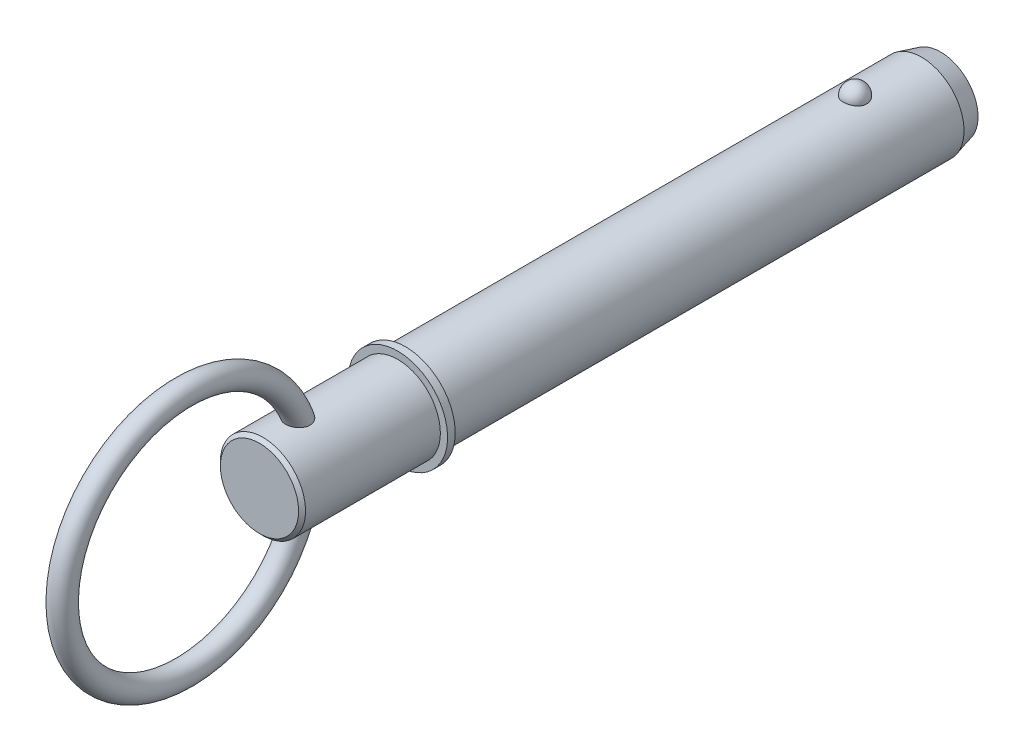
ISO-10303-21;
HEADER;
FILE_DESCRIPTION(('STEP AP214'),'2;1');
FILE_NAME('part.step','',(''),(''),'','','');
FILE_SCHEMA(('AUTOMOTIVE_DESIGN { 1 0 10303 214 1 1 1 1 }'));
ENDSEC;
DATA;
#1=APPLICATION_CONTEXT('core data for automotive mechanical design processes');
#2=APPLICATION_PROTOCOL_DEFINITION('international standard','automotive_design',2000,#1);
#3=PRODUCT_CONTEXT('',#1,'mechanical');
#4=PRODUCT('Part','Part','',(#3));
#5=PRODUCT_RELATED_PRODUCT_CATEGORY('part','',(#4));
#6=PRODUCT_DEFINITION_FORMATION('','',#4);
#7=PRODUCT_DEFINITION_CONTEXT('part definition',#1,'design');
#8=PRODUCT_DEFINITION('design','',#6,#7);
#9=PRODUCT_DEFINITION_SHAPE('','',#8);
#10=(LENGTH_UNIT() NAMED_UNIT(*) SI_UNIT(.MILLI.,.METRE.));
#11=(NAMED_UNIT(*) PLANE_ANGLE_UNIT() SI_UNIT($,.RADIAN.));
#12=(NAMED_UNIT(*) SI_UNIT($,.STERADIAN.) SOLID_ANGLE_UNIT());
#13=UNCERTAINTY_MEASURE_WITH_UNIT(LENGTH_MEASURE(1.E-05),#10,'distance_accuracy_value','');
#14=(GEOMETRIC_REPRESENTATION_CONTEXT(3) GLOBAL_UNCERTAINTY_ASSIGNED_CONTEXT((#13)) GLOBAL_UNIT_ASSIGNED_CONTEXT((#10,
#11,#12)) REPRESENTATION_CONTEXT('',''));
#15=CARTESIAN_POINT('',(0.,0.,0.));
#16=DIRECTION('',(0.,0.,1.));
#17=DIRECTION('',(1.,0.,0.));
#18=AXIS2_PLACEMENT_3D('',#15,#16,#17);
#19=CARTESIAN_POINT('',(0.,0.,114.3));
#20=DIRECTION('',(0.,0.,-1.));
#21=DIRECTION('',(-1.,0.,0.));
#22=AXIS2_PLACEMENT_3D('',#19,#20,#21);
#23=CYLINDRICAL_SURFACE('',#22,11.115);
#24=CARTESIAN_POINT('',(3.04058343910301,10.6910278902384,-3.07));
#25=CARTESIAN_POINT('',(3.04058039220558,10.6910304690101,-2.89837124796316));
#26=CARTESIAN_POINT('',(3.02657193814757,10.6950430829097,-2.72670368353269));
#27=CARTESIAN_POINT('',(2.97087341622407,10.7106465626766,-2.38822964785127));
#28=CARTESIAN_POINT('',(2.92917240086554,10.7222404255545,-2.22142512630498));
#29=CARTESIAN_POINT('',(2.81915317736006,10.751689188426,-1.89750816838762));
#30=CARTESIAN_POINT('',(2.75084669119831,10.7695413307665,-1.7403914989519));
#31=CARTESIAN_POINT('',(2.58932284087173,10.809510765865,-1.44013959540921));
#32=CARTESIAN_POINT('',(2.49610617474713,10.8316279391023,-1.29700396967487));
#33=CARTESIAN_POINT('',(2.28659317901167,10.877786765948,-1.02797591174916));
#34=CARTESIAN_POINT('',(2.17018825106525,10.9018371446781,-0.902169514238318));
#35=CARTESIAN_POINT('',(1.91759004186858,10.9490888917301,-0.672091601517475));
#36=CARTESIAN_POINT('',(1.78139672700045,10.9722902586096,-0.567820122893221));
#37=CARTESIAN_POINT('',(1.49327884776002,11.0151925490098,-0.383992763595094));
#38=CARTESIAN_POINT('',(1.34139928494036,11.034903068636,-0.30436866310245));
#39=CARTESIAN_POINT('',(1.02584823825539,11.0686948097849,-0.171731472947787));
#40=CARTESIAN_POINT('',(0.86217801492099,11.0827766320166,-0.118715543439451));
#41=CARTESIAN_POINT('',(0.530748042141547,11.1035404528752,-0.0415304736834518));
#42=CARTESIAN_POINT('',(0.363109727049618,11.1103474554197,-0.0168734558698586));
#43=CARTESIAN_POINT('',(0.0259327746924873,11.1162480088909,0.00453486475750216));
#44=CARTESIAN_POINT('',(-0.143605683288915,11.1153422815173,0.00128877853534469));
#45=CARTESIAN_POINT('',(-0.477280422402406,11.1059854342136,-0.0327676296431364));
#46=CARTESIAN_POINT('',(-0.641459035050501,11.0976393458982,-0.0631942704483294));
#47=CARTESIAN_POINT('',(-0.962236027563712,11.0744390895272,-0.150220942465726));
#48=CARTESIAN_POINT('',(-1.11883427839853,11.0595848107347,-0.20682141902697));
#49=CARTESIAN_POINT('',(-1.4210461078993,11.0248420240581,-0.345028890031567));
#50=CARTESIAN_POINT('',(-1.56659244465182,11.0049254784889,-0.426775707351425));
#51=CARTESIAN_POINT('',(-1.84189316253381,10.9622119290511,-0.612956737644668));
#52=CARTESIAN_POINT('',(-1.97164597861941,10.9394146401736,-0.71739319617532));
#53=CARTESIAN_POINT('',(-2.21432263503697,10.8929139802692,-0.948332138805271));
#54=CARTESIAN_POINT('',(-2.3268890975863,10.8692016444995,-1.07520847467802));
#55=CARTESIAN_POINT('',(-2.52940007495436,10.8238699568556,-1.34622145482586));
#56=CARTESIAN_POINT('',(-2.6193430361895,10.8022507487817,-1.49035928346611));
#57=CARTESIAN_POINT('',(-2.77523958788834,10.7632629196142,-1.79367507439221));
#58=CARTESIAN_POINT('',(-2.8409151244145,10.7459442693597,-1.95300253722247));
#59=CARTESIAN_POINT('',(-2.94519180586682,10.7178360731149,-2.28083009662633));
#60=CARTESIAN_POINT('',(-2.98379371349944,10.707046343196,-2.44932993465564));
#61=CARTESIAN_POINT('',(-3.03284665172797,10.6932559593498,-2.78998091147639));
#62=CARTESIAN_POINT('',(-3.04341313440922,10.6902233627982,-2.96211412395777));
#63=CARTESIAN_POINT('',(-3.03646037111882,10.6922002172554,-3.305762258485));
#64=CARTESIAN_POINT('',(-3.0189418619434,10.6972094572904,-3.47727719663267));
#65=CARTESIAN_POINT('',(-2.95641582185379,10.7146564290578,-3.81396465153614));
#66=CARTESIAN_POINT('',(-2.91154117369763,10.7270582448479,-3.97916375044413));
#67=CARTESIAN_POINT('',(-2.79553341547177,10.7578713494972,-4.29947360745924));
#68=CARTESIAN_POINT('',(-2.72439927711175,10.7762828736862,-4.45458397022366));
#69=CARTESIAN_POINT('',(-2.55718900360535,10.8171819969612,-4.75123550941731));
#70=CARTESIAN_POINT('',(-2.46098224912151,10.8396907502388,-4.89270014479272));
#71=CARTESIAN_POINT('',(-2.24623042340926,10.8862165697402,-5.15724095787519));
#72=CARTESIAN_POINT('',(-2.12768452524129,10.9102336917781,-5.28031645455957));
#73=CARTESIAN_POINT('',(-1.87085107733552,10.9571990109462,-5.5050961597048));
#74=CARTESIAN_POINT('',(-1.73249451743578,10.9801430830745,-5.60672245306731));
#75=CARTESIAN_POINT('',(-1.44010079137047,11.0223008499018,-5.78517789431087));
#76=CARTESIAN_POINT('',(-1.28606470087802,11.0415148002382,-5.86200874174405));
#77=CARTESIAN_POINT('',(-0.968615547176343,11.0738491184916,-5.98788441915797));
#78=CARTESIAN_POINT('',(-0.805339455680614,11.0870408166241,-6.03725610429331));
#79=CARTESIAN_POINT('',(-0.47244987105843,11.1062048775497,-6.10820004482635));
#80=CARTESIAN_POINT('',(-0.302837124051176,11.11217808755,-6.1297755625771));
#81=CARTESIAN_POINT('',(0.0345765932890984,11.1162034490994,-6.14436196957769));
#82=CARTESIAN_POINT('',(0.20235372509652,11.1143988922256,-6.13788957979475));
#83=CARTESIAN_POINT('',(0.534364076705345,11.103390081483,-6.09773981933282));
#84=CARTESIAN_POINT('',(0.698597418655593,11.094186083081,-6.06406338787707));
#85=CARTESIAN_POINT('',(1.01830314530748,11.0694136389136,-5.97063285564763));
#86=CARTESIAN_POINT('',(1.17380497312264,11.0538682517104,-5.91097318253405));
#87=CARTESIAN_POINT('',(1.472484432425,11.0180608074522,-5.76723645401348));
#88=CARTESIAN_POINT('',(1.6156613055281,10.9977984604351,-5.68315789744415));
#89=CARTESIAN_POINT('',(1.88801614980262,10.9543574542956,-5.49138807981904));
#90=CARTESIAN_POINT('',(2.01695079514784,10.9311394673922,-5.38336024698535));
#91=CARTESIAN_POINT('',(2.25501495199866,10.8845248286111,-5.14733839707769));
#92=CARTESIAN_POINT('',(2.36414099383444,10.8611281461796,-5.01934088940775));
#93=CARTESIAN_POINT('',(2.56152595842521,10.8162958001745,-4.74447932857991));
#94=CARTESIAN_POINT('',(2.64940088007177,10.7948999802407,-4.59733288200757));
#95=CARTESIAN_POINT('',(2.79961494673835,10.7569242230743,-4.29001203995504));
#96=CARTESIAN_POINT('',(2.86196390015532,10.7403424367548,-4.12984267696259));
#97=CARTESIAN_POINT('',(2.95377333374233,10.715429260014,-3.820623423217));
#98=CARTESIAN_POINT('',(2.98627018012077,10.7063495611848,-3.6725268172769));
#99=CARTESIAN_POINT('',(3.02967634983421,10.6941478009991,-3.37296350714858));
#100=CARTESIAN_POINT('',(3.04058612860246,10.6910256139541,-3.22149687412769));
#101=CARTESIAN_POINT('',(3.04058343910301,10.6910278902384,-3.07));
#102=B_SPLINE_CURVE_WITH_KNOTS('',3,(#24,#25,#26,#27,#28,#29,#30,#31,#32,#33,#34,#35,#36,#37,
#38,#39,#40,#41,#42,#43,#44,#45,#46,#47,#48,#49,#50,#51,#52,#53,#54,#55,#56,#57,#58,#59,#60,#61,
#62,#63,#64,#65,#66,#67,#68,#69,#70,#71,#72,#73,#74,#75,#76,#77,#78,#79,#80,#81,#82,#83,#84,#85,
#86,#87,#88,#89,#90,#91,#92,#93,#94,#95,#96,#97,#98,#99,#100,#101),.UNSPECIFIED.,.T.,.F.,(4,2,2,
2,2,2,2,2,2,2,2,2,2,2,2,2,2,2,2,2,2,2,2,2,2,2,2,2,2,2,2,2,2,2,2,2,2,2,4),(0.,0.514341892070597,
1.02888723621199,1.54320613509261,2.0575106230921,2.57428293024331,3.09105611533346,
3.60638589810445,4.1216606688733,4.62793159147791,5.1341551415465,5.63334381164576,
6.13254097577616,6.63456562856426,7.13663998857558,7.64804063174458,8.15947638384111,
8.6766026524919,9.19371435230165,9.70869321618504,10.223658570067,10.7361421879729,
11.2486458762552,11.7638748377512,12.2791228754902,12.7962115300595,13.3132647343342,
13.8240238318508,14.3347229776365,14.8360540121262,15.3373677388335,15.8368746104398,
16.3364121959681,16.8434736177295,17.3506237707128,17.8663484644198,18.3818748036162,
18.8358944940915,19.2899046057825),.UNSPECIFIED.);
#103=CARTESIAN_POINT('',(3.04058343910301,10.6910278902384,-3.07));
#104=VERTEX_POINT('',#103);
#105=EDGE_CURVE('E100',#104,#104,#102,.T.);
#106=ORIENTED_EDGE('',*,*,#105,.T.);
#107=EDGE_LOOP('',(#106));
#108=FACE_BOUND('',#107,.T.);
#109=CARTESIAN_POINT('',(0.,0.,-20.3999999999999));
#110=DIRECTION('',(0.,0.,-1.));
#111=DIRECTION('',(-1.,0.,0.));
#112=AXIS2_PLACEMENT_3D('',#109,#110,#111);
#113=CIRCLE('',#112,11.115);
#114=CARTESIAN_POINT('',(-11.115,0.,-20.3999999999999));
#115=VERTEX_POINT('',#114);
#116=EDGE_CURVE('E108',#115,#115,#113,.F.);
#117=ORIENTED_EDGE('',*,*,#116,.T.);
#118=EDGE_LOOP('',(#117));
#119=FACE_BOUND('',#118,.T.);
#120=CARTESIAN_POINT('',(0.,0.,114.3));
#121=DIRECTION('',(0.,0.,1.));
#122=DIRECTION('',(1.,0.,0.));
#123=AXIS2_PLACEMENT_3D('',#120,#121,#122);
#124=CIRCLE('',#123,11.115);
#125=CARTESIAN_POINT('',(11.115,0.,114.3));
#126=VERTEX_POINT('',#125);
#127=EDGE_CURVE('E106',#126,#126,#124,.T.);
#128=ORIENTED_EDGE('',*,*,#127,.F.);
#129=EDGE_LOOP('',(#128));
#130=FACE_BOUND('',#129,.T.);
#131=ADVANCED_FACE('F39',(#108,#119,#130),#23,.T.);
#132=CARTESIAN_POINT('',(0.,0.,-25.4));
#133=DIRECTION('',(0.,0.,-1.));
#134=DIRECTION('',(-1.,0.,0.));
#135=AXIS2_PLACEMENT_3D('',#132,#133,#134);
#136=PLANE('',#135);
#137=CARTESIAN_POINT('',(0.,0.,-25.4));
#138=DIRECTION('',(0.,0.,-1.));
#139=DIRECTION('',(-1.,0.,0.));
#140=AXIS2_PLACEMENT_3D('',#137,#138,#139);
#141=CIRCLE('',#140,9.77525403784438);
#142=CARTESIAN_POINT('',(-9.77525403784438,0.,-25.4));
#143=VERTEX_POINT('',#142);
#144=EDGE_CURVE('E142',#143,#143,#141,.T.);
#145=ORIENTED_EDGE('',*,*,#144,.T.);
#146=EDGE_LOOP('',(#145));
#147=FACE_BOUND('',#146,.T.);
#148=ADVANCED_FACE('F86',(#147),#136,.T.);
#149=CARTESIAN_POINT('',(0.,0.,-25.4));
#150=DIRECTION('',(0.,0.,1.));
#151=DIRECTION('',(1.,0.,0.));
#152=AXIS2_PLACEMENT_3D('',#149,#150,#151);
#153=CONICAL_SURFACE('',#152,9.77525403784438,0.261799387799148);
#154=ORIENTED_EDGE('',*,*,#116,.F.);
#155=EDGE_LOOP('',(#154));
#156=FACE_BOUND('',#155,.T.);
#157=ORIENTED_EDGE('',*,*,#144,.F.);
#158=EDGE_LOOP('',(#157));
#159=FACE_BOUND('',#158,.T.);
#160=ADVANCED_FACE('F92',(#156,#159),#153,.T.);
#161=CARTESIAN_POINT('',(0.,11.115,-3.07));
#162=DIRECTION('',(0.,1.,0.));
#163=DIRECTION('',(0.,0.,1.));
#164=AXIS2_PLACEMENT_3D('',#161,#162,#163);
#165=SPHERICAL_SURFACE('',#164,3.07);
#166=ORIENTED_EDGE('',*,*,#105,.F.);
#167=EDGE_LOOP('',(#166));
#168=FACE_BOUND('',#167,.T.);
#169=ADVANCED_FACE('F111',(#168),#165,.T.);
#170=CARTESIAN_POINT('',(0.,0.,114.3));
#171=DIRECTION('',(0.,0.,-1.));
#172=DIRECTION('',(-1.,0.,0.));
#173=AXIS2_PLACEMENT_3D('',#170,#171,#172);
#174=PLANE('',#173);
#175=ORIENTED_EDGE('',*,*,#127,.T.);
#176=EDGE_LOOP('',(#175));
#177=FACE_BOUND('',#176,.T.);
#178=CARTESIAN_POINT('',(0.,0.,114.3));
#179=DIRECTION('',(0.,0.,-1.));
#180=DIRECTION('',(-1.,0.,0.));
#181=AXIS2_PLACEMENT_3D('',#178,#179,#180);
#182=CIRCLE('',#181,13.);
#183=CARTESIAN_POINT('',(-13.,0.,114.3));
#184=VERTEX_POINT('',#183);
#185=EDGE_CURVE('E107',#184,#184,#182,.T.);
#186=ORIENTED_EDGE('',*,*,#185,.T.);
#187=EDGE_LOOP('',(#186));
#188=FACE_BOUND('',#187,.T.);
#189=ADVANCED_FACE('F115',(#177,#188),#174,.T.);
#190=CARTESIAN_POINT('',(0.,0.,33.7287874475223));
#191=DIRECTION('',(0.,0.,-1.));
#192=DIRECTION('',(-1.,0.,0.));
#193=AXIS2_PLACEMENT_3D('',#190,#191,#192);
#194=CYLINDRICAL_SURFACE('',#193,13.);
#195=CARTESIAN_POINT('',(0.,0.,116.3));
#196=DIRECTION('',(0.,0.,-1.));
#197=DIRECTION('',(-1.,0.,0.));
#198=AXIS2_PLACEMENT_3D('',#195,#196,#197);
#199=CIRCLE('',#198,13.);
#200=CARTESIAN_POINT('',(-13.,0.,116.3));
#201=VERTEX_POINT('',#200);
#202=EDGE_CURVE('E132',#201,#201,#199,.T.);
#203=ORIENTED_EDGE('',*,*,#202,.T.);
#204=EDGE_LOOP('',(#203));
#205=FACE_BOUND('',#204,.T.);
#206=ORIENTED_EDGE('',*,*,#185,.F.);
#207=EDGE_LOOP('',(#206));
#208=FACE_BOUND('',#207,.T.);
#209=ADVANCED_FACE('F119',(#205,#208),#194,.T.);
#210=CARTESIAN_POINT('',(0.,13.,116.3));
#211=DIRECTION('',(0.,0.,1.));
#212=DIRECTION('',(1.,0.,0.));
#213=AXIS2_PLACEMENT_3D('',#210,#211,#212);
#214=PLANE('',#213);
#215=CARTESIAN_POINT('',(0.,0.,116.3));
#216=DIRECTION('',(0.,0.,1.));
#217=DIRECTION('',(1.,0.,0.));
#218=AXIS2_PLACEMENT_3D('',#215,#216,#217);
#219=CIRCLE('',#218,11.115);
#220=CARTESIAN_POINT('',(11.115,0.,116.3));
#221=VERTEX_POINT('',#220);
#222=EDGE_CURVE('E110',#221,#221,#219,.T.);
#223=ORIENTED_EDGE('',*,*,#222,.F.);
#224=EDGE_LOOP('',(#223));
#225=FACE_BOUND('',#224,.T.);
#226=ORIENTED_EDGE('',*,*,#202,.F.);
#227=EDGE_LOOP('',(#226));
#228=FACE_BOUND('',#227,.T.);
#229=ADVANCED_FACE('F83',(#225,#228),#214,.T.);
#230=CARTESIAN_POINT('',(0.,0.,152.4));
#231=DIRECTION('',(0.,0.,-1.));
#232=DIRECTION('',(-1.,0.,0.));
#233=AXIS2_PLACEMENT_3D('',#230,#231,#232);
#234=CYLINDRICAL_SURFACE('',#233,11.115);
#235=CARTESIAN_POINT('',(-1.22435852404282,-11.0473603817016,139.478419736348));
#236=CARTESIAN_POINT('',(-1.0707801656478,-11.0643805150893,139.411699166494));
#237=CARTESIAN_POINT('',(-0.911372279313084,-11.0787777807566,139.357745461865));
#238=CARTESIAN_POINT('',(-0.585451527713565,-11.1007717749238,139.276552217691));
#239=CARTESIAN_POINT('',(-0.418938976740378,-11.1083688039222,139.249311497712));
#240=CARTESIAN_POINT('',(-0.0835394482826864,-11.1159515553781,139.222121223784));
#241=CARTESIAN_POINT('',(0.0853474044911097,-11.1159376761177,139.222170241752));
#242=CARTESIAN_POINT('',(0.420723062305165,-11.1083011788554,139.249554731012));
#243=CARTESIAN_POINT('',(0.58721183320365,-11.1006784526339,139.276890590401));
#244=CARTESIAN_POINT('',(0.913189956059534,-11.0786293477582,139.35829957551));
#245=CARTESIAN_POINT('',(1.07267378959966,-11.0641977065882,139.412393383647));
#246=CARTESIAN_POINT('',(1.3799404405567,-11.0300907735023,139.546140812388));
#247=CARTESIAN_POINT('',(1.52772335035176,-11.0104155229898,139.625794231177));
#248=CARTESIAN_POINT('',(1.80679367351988,-10.9680716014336,139.808467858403));
#249=CARTESIAN_POINT('',(1.93814041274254,-10.945414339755,139.911400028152));
#250=CARTESIAN_POINT('',(2.18117403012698,-10.8995884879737,140.138212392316));
#251=CARTESIAN_POINT('',(2.29286356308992,-10.8764199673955,140.262089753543));
#252=CARTESIAN_POINT('',(2.49238969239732,-10.8324319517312,140.525992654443));
#253=CARTESIAN_POINT('',(2.58046870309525,-10.8115899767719,140.665831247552));
#254=CARTESIAN_POINT('',(2.73218762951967,-10.7742522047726,140.958691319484));
#255=CARTESIAN_POINT('',(2.7958294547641,-10.757756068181,141.111711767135));
#256=CARTESIAN_POINT('',(2.89767977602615,-10.7307723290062,141.4266092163));
#257=CARTESIAN_POINT('',(2.93586554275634,-10.7202900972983,141.588493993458));
#258=CARTESIAN_POINT('',(2.98678800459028,-10.7062139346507,141.916480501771));
#259=CARTESIAN_POINT('',(2.99951894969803,-10.7026215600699,142.082583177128));
#260=CARTESIAN_POINT('',(3.0004780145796,-10.7023530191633,142.423227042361));
#261=CARTESIAN_POINT('',(2.98743421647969,-10.7060358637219,142.597770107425));
#262=CARTESIAN_POINT('',(2.93592917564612,-10.7202719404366,142.942750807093));
#263=CARTESIAN_POINT('',(2.8974582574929,-10.7308277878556,143.113186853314));
#264=CARTESIAN_POINT('',(2.79180512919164,-10.7588257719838,143.463114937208));
#265=CARTESIAN_POINT('',(2.72213928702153,-10.776850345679,143.641811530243));
#266=CARTESIAN_POINT('',(2.55612841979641,-10.8174264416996,143.985974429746));
#267=CARTESIAN_POINT('',(2.4597569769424,-10.8399824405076,144.151427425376));
#268=CARTESIAN_POINT('',(2.23434632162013,-10.8887625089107,144.475672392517));
#269=CARTESIAN_POINT('',(2.10349593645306,-10.9151327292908,144.633192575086));
#270=CARTESIAN_POINT('',(1.81505097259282,-10.96677510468,144.921668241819));
#271=CARTESIAN_POINT('',(1.65749731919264,-10.9920488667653,145.05266371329));
#272=CARTESIAN_POINT('',(1.36197799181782,-11.0319737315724,145.251313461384));
#273=CARTESIAN_POINT('',(1.22927684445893,-11.0476896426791,145.32660092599));
#274=CARTESIAN_POINT('',(0.952979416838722,-11.0749380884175,145.454574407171));
#275=CARTESIAN_POINT('',(0.809393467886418,-11.0864745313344,145.507281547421));
#276=CARTESIAN_POINT('',(0.513954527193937,-11.1041011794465,145.587058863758));
#277=CARTESIAN_POINT('',(0.362058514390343,-11.1101594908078,145.613978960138));
#278=CARTESIAN_POINT('',(0.0557792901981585,-11.1159132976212,145.639559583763));
#279=CARTESIAN_POINT('',(-0.0986030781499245,-11.1156109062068,145.638229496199));
#280=CARTESIAN_POINT('',(-0.389768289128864,-11.1090283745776,145.608935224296));
#281=CARTESIAN_POINT('',(-0.526830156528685,-11.1033186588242,145.583512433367));
#282=CARTESIAN_POINT('',(-0.794878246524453,-11.0873547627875,145.511270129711));
#283=CARTESIAN_POINT('',(-0.925863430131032,-11.0770998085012,145.464446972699));
#284=CARTESIAN_POINT('',(-1.18354406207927,-11.0525934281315,145.349843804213));
#285=CARTESIAN_POINT('',(-1.30991621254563,-11.0382116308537,145.281371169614));
#286=CARTESIAN_POINT('',(-1.55122352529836,-11.0068962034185,145.127131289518));
#287=CARTESIAN_POINT('',(-1.66615377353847,-10.9899614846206,145.041356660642));
#288=CARTESIAN_POINT('',(-1.90024050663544,-10.9520991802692,144.84087205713));
#289=CARTESIAN_POINT('',(-2.01728342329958,-10.9309598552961,144.723737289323));
#290=CARTESIAN_POINT('',(-2.23333659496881,-10.8888735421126,144.473839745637));
#291=CARTESIAN_POINT('',(-2.33233396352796,-10.8679267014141,144.341065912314));
#292=CARTESIAN_POINT('',(-2.52607041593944,-10.8246766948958,144.040000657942));
#293=CARTESIAN_POINT('',(-2.61741570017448,-10.8027194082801,143.869462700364));
#294=CARTESIAN_POINT('',(-2.77251687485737,-10.7639568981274,143.515671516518));
#295=CARTESIAN_POINT('',(-2.83625783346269,-10.7471544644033,143.332411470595));
#296=CARTESIAN_POINT('',(-2.93668505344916,-10.7201706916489,142.946624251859));
#297=CARTESIAN_POINT('',(-2.97161961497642,-10.7104219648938,142.743594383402));
#298=CARTESIAN_POINT('',(-2.99683495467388,-10.7033740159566,142.436874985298));
#299=CARTESIAN_POINT('',(-3.00070536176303,-10.7022882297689,142.334234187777));
#300=CARTESIAN_POINT('',(-2.99908594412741,-10.7027439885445,142.129049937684));
#301=CARTESIAN_POINT('',(-2.99360154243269,-10.7042840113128,142.026506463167));
#302=CARTESIAN_POINT('',(-2.97382504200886,-10.7097936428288,141.830330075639));
#303=CARTESIAN_POINT('',(-2.9602439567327,-10.7135669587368,141.736619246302));
#304=CARTESIAN_POINT('',(-2.92480741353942,-10.723295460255,141.550932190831));
#305=CARTESIAN_POINT('',(-2.90295619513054,-10.7292495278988,141.45895510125));
#306=CARTESIAN_POINT('',(-2.85097003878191,-10.7431800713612,141.277547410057));
#307=CARTESIAN_POINT('',(-2.82083748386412,-10.7511559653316,141.188116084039));
#308=CARTESIAN_POINT('',(-2.75241691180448,-10.7688750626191,141.01264532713));
#309=CARTESIAN_POINT('',(-2.71412954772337,-10.7786181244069,140.92660562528));
#310=CARTESIAN_POINT('',(-2.59550576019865,-10.807996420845,140.691055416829));
#311=CARTESIAN_POINT('',(-2.50612224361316,-10.8292837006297,140.546173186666));
#312=CARTESIAN_POINT('',(-2.30366035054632,-10.8741467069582,140.274571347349));
#313=CARTESIAN_POINT('',(-2.19058370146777,-10.8977222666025,140.147850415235));
#314=CARTESIAN_POINT('',(-1.94442412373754,-10.9443154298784,139.916462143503));
#315=CARTESIAN_POINT('',(-1.81141354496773,-10.967334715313,139.81171820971));
#316=CARTESIAN_POINT('',(-1.52904284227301,-11.0102504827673,139.626435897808));
#317=CARTESIAN_POINT('',(-1.37968206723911,-11.0301468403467,139.545898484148));
#318=CARTESIAN_POINT('',(-1.22435852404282,-11.0473603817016,139.478419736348));
#319=B_SPLINE_CURVE_WITH_KNOTS('',3,(#235,#236,#237,#238,#239,#240,#241,#242,#243,#244,#245,
#246,#247,#248,#249,#250,#251,#252,#253,#254,#255,#256,#257,#258,#259,#260,#261,#262,#263,#264,
#265,#266,#267,#268,#269,#270,#271,#272,#273,#274,#275,#276,#277,#278,#279,#280,#281,#282,#283,
#284,#285,#286,#287,#288,#289,#290,#291,#292,#293,#294,#295,#296,#297,#298,#299,#300,#301,#302,
#303,#304,#305,#306,#307,#308,#309,#310,#311,#312,#313,#314,#315,#316,#317,#318),.UNSPECIFIED.,
.T.,.F.,(4,2,2,2,2,2,2,2,2,2,2,2,2,2,2,2,2,2,2,2,2,2,2,2,2,2,2,2,2,2,2,2,2,2,2,2,2,2,2,2,2,4),
(0.,0.504317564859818,1.00861284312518,1.51288173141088,2.01715779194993,2.52182424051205,
3.02648670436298,3.52927157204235,4.03198848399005,4.52932690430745,5.02662645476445,
5.5243694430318,6.02222485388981,6.545261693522,7.06849767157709,7.64398785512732,
8.22004937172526,8.83633461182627,9.45168373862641,9.90997173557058,10.3678300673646,
10.8283372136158,11.2886913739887,11.7053264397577,12.1220324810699,12.5537129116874,
12.9855779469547,13.4844842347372,13.9837454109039,14.5653303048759,15.1472294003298,
15.762338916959,16.0701226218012,16.3777279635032,16.6616380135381,16.9454027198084,
17.229085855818,17.5127462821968,18.0246262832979,18.5364689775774,19.0464970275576,
19.5565453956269),.UNSPECIFIED.);
#320=CARTESIAN_POINT('',(-1.22435852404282,-11.0473603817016,139.478419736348));
#321=VERTEX_POINT('',#320);
#322=EDGE_CURVE('E10',#321,#321,#319,.T.);
#323=ORIENTED_EDGE('',*,*,#322,.F.);
#324=EDGE_LOOP('',(#323));
#325=FACE_BOUND('',#324,.T.);
#326=CARTESIAN_POINT('',(-1.22435852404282,11.0473603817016,139.478419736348));
#327=CARTESIAN_POINT('',(-1.3763077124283,11.0305212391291,139.544431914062));
#328=CARTESIAN_POINT('',(-1.5225432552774,11.0111158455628,139.622938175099));
#329=CARTESIAN_POINT('',(-1.79945383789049,10.9692671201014,139.80315338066));
#330=CARTESIAN_POINT('',(-1.9301301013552,10.9468240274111,139.904860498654));
#331=CARTESIAN_POINT('',(-2.17227655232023,10.9013603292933,140.129035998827));
#332=CARTESIAN_POINT('',(-2.28373752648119,10.8783394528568,140.251514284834));
#333=CARTESIAN_POINT('',(-2.4842745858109,10.8343057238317,140.513895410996));
#334=CARTESIAN_POINT('',(-2.57335330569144,10.8132926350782,140.653796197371));
#335=CARTESIAN_POINT('',(-2.72640074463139,10.7757209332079,140.945964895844));
#336=CARTESIAN_POINT('',(-2.79054231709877,10.7591319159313,141.09813851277));
#337=CARTESIAN_POINT('',(-2.89354234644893,10.7318913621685,141.411286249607));
#338=CARTESIAN_POINT('',(-2.932399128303,10.7212402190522,141.572260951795));
#339=CARTESIAN_POINT('',(-2.98540436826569,10.7066038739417,141.901955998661));
#340=CARTESIAN_POINT('',(-2.99901659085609,10.7027634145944,142.070768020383));
#341=CARTESIAN_POINT('',(-3.0008814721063,10.7022388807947,142.408508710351));
#342=CARTESIAN_POINT('',(-2.98912652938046,10.7055569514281,142.577437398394));
#343=CARTESIAN_POINT('',(-2.93985175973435,10.7191979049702,142.924856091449));
#344=CARTESIAN_POINT('',(-2.90036626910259,10.7300544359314,143.103044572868));
#345=CARTESIAN_POINT('',(-2.7955500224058,10.7578360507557,143.451215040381));
#346=CARTESIAN_POINT('',(-2.73019988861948,10.774765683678,143.621190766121));
#347=CARTESIAN_POINT('',(-2.56762574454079,10.8147227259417,143.965784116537));
#348=CARTESIAN_POINT('',(-2.46786230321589,10.838191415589,144.139157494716));
#349=CARTESIAN_POINT('',(-2.24100420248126,10.8873575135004,144.466686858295));
#350=CARTESIAN_POINT('',(-2.11391925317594,10.9130541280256,144.620849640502));
#351=CARTESIAN_POINT('',(-1.85542700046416,10.9597063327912,144.882735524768));
#352=CARTESIAN_POINT('',(-1.72758345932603,10.9807909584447,144.993955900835));
#353=CARTESIAN_POINT('',(-1.45489931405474,11.0202250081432,145.19412236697));
#354=CARTESIAN_POINT('',(-1.31006770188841,11.0385758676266,145.283080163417));
#355=CARTESIAN_POINT('',(-1.08171164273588,11.0625084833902,145.3963702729));
#356=CARTESIAN_POINT('',(-1.00332234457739,11.069914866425,145.430896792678));
#357=CARTESIAN_POINT('',(-0.843525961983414,11.0832350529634,145.492391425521));
#358=CARTESIAN_POINT('',(-0.76212057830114,11.0891496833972,145.519363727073));
#359=CARTESIAN_POINT('',(-0.597014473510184,11.0992628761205,145.56518193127));
#360=CARTESIAN_POINT('',(-0.513315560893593,11.1034627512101,145.584034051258));
#361=CARTESIAN_POINT('',(-0.344374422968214,11.1099851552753,145.613209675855));
#362=CARTESIAN_POINT('',(-0.259132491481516,11.1123080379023,145.623534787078));
#363=CARTESIAN_POINT('',(-0.100838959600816,11.114780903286,145.634519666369));
#364=CARTESIAN_POINT('',(-0.027873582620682,11.1152042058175,145.636395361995));
#365=CARTESIAN_POINT('',(0.117962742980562,11.1146132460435,145.633773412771));
#366=CARTESIAN_POINT('',(0.190833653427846,11.1135985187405,145.629273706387));
#367=CARTESIAN_POINT('',(0.33584265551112,11.110161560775,145.613978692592));
#368=CARTESIAN_POINT('',(0.407981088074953,11.1077400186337,145.603186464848));
#369=CARTESIAN_POINT('',(0.551029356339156,11.1015643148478,145.575503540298));
#370=CARTESIAN_POINT('',(0.621938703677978,11.0978096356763,145.558610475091));
#371=CARTESIAN_POINT('',(0.82538178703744,11.0851145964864,145.501054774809));
#372=CARTESIAN_POINT('',(0.955713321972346,11.0745538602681,145.452705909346));
#373=CARTESIAN_POINT('',(1.20733127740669,11.0499605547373,145.337325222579));
#374=CARTESIAN_POINT('',(1.32861527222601,11.0359270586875,145.270288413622));
#375=CARTESIAN_POINT('',(1.57344360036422,11.0038352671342,145.111843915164));
#376=CARTESIAN_POINT('',(1.69572941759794,10.9855025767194,145.018551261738));
#377=CARTESIAN_POINT('',(1.92565215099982,10.9475431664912,144.815650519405));
#378=CARTESIAN_POINT('',(2.0332801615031,10.9279156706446,144.706032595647));
#379=CARTESIAN_POINT('',(2.25048911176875,10.8854412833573,144.45299112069));
#380=CARTESIAN_POINT('',(2.35710396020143,10.8626332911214,144.307010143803));
#381=CARTESIAN_POINT('',(2.5475731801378,10.8195493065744,144.000478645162));
#382=CARTESIAN_POINT('',(2.63141052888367,10.799275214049,143.839917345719));
#383=CARTESIAN_POINT('',(2.78342312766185,10.7611645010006,143.487827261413));
#384=CARTESIAN_POINT('',(2.84851472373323,10.7439117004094,143.294893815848));
#385=CARTESIAN_POINT('',(2.9456265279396,10.7177011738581,142.900130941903));
#386=CARTESIAN_POINT('',(2.97764942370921,10.7087427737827,142.69830223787));
#387=CARTESIAN_POINT('',(2.99864828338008,10.7028651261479,142.395989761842));
#388=CARTESIAN_POINT('',(3.00125529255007,10.7021342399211,142.296378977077));
#389=CARTESIAN_POINT('',(2.9976304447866,10.7031517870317,142.097345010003));
#390=CARTESIAN_POINT('',(2.99140295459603,10.704898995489,141.997921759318));
#391=CARTESIAN_POINT('',(2.96990080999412,10.710883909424,141.800179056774));
#392=CARTESIAN_POINT('',(2.95463019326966,10.7151205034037,141.701859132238));
#393=CARTESIAN_POINT('',(2.91493260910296,10.7259879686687,141.507219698));
#394=CARTESIAN_POINT('',(2.89050674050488,10.7326185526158,141.410899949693));
#395=CARTESIAN_POINT('',(2.83556656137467,10.7472556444,141.231222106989));
#396=CARTESIAN_POINT('',(2.80596337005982,10.7550439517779,141.147566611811));
#397=CARTESIAN_POINT('',(2.73953102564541,10.7721572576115,140.983300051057));
#398=CARTESIAN_POINT('',(2.7026993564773,10.7814827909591,140.902690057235));
#399=CARTESIAN_POINT('',(2.6220344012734,10.801383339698,140.745273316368));
#400=CARTESIAN_POINT('',(2.57820565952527,10.8119575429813,140.668464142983));
#401=CARTESIAN_POINT('',(2.48382482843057,10.8340293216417,140.519223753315));
#402=CARTESIAN_POINT('',(2.4332703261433,10.8455272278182,140.446794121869));
#403=CARTESIAN_POINT('',(2.27895739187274,10.879345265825,140.245992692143));
#404=CARTESIAN_POINT('',(2.16717186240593,10.9023791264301,140.123764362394));
#405=CARTESIAN_POINT('',(1.92442677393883,10.9478318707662,139.900151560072));
#406=CARTESIAN_POINT('',(1.79346836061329,10.9702507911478,139.798765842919));
#407=CARTESIAN_POINT('',(1.51657151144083,11.0119360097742,139.619564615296));
#408=CARTESIAN_POINT('',(1.37069187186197,11.0312139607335,139.541661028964));
#409=CARTESIAN_POINT('',(1.0676440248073,11.0646548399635,139.410680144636));
#410=CARTESIAN_POINT('',(0.910475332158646,11.0788175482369,139.357603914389));
#411=CARTESIAN_POINT('',(0.587492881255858,11.1006548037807,139.27697871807));
#412=CARTESIAN_POINT('',(0.421604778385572,11.1082585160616,139.249708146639));
#413=CARTESIAN_POINT('',(0.0874262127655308,11.1159127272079,139.222259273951));
#414=CARTESIAN_POINT('',(-0.080864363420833,11.1159628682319,139.22208225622));
#415=CARTESIAN_POINT('',(-0.416252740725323,11.1084780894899,139.248918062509));
#416=CARTESIAN_POINT('',(-0.583334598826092,11.1008914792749,139.276116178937));
#417=CARTESIAN_POINT('',(-0.910355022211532,11.0788693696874,139.357401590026));
#418=CARTESIAN_POINT('',(-1.07029370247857,11.064433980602,139.411488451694));
#419=CARTESIAN_POINT('',(-1.22435852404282,11.0473603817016,139.478419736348));
#420=B_SPLINE_CURVE_WITH_KNOTS('',3,(#326,#327,#328,#329,#330,#331,#332,#333,#334,#335,#336,
#337,#338,#339,#340,#341,#342,#343,#344,#345,#346,#347,#348,#349,#350,#351,#352,#353,#354,#355,
#356,#357,#358,#359,#360,#361,#362,#363,#364,#365,#366,#367,#368,#369,#370,#371,#372,#373,#374,
#375,#376,#377,#378,#379,#380,#381,#382,#383,#384,#385,#386,#387,#388,#389,#390,#391,#392,#393,
#394,#395,#396,#397,#398,#399,#400,#401,#402,#403,#404,#405,#406,#407,#408,#409,#410,#411,#412,
#413,#414,#415,#416,#417,#418,#419),.UNSPECIFIED.,.T.,.F.,(4,2,2,2,2,2,2,2,2,2,2,2,2,2,2,2,2,2,
2,2,2,2,2,2,2,2,2,2,2,2,2,2,2,2,2,2,2,2,2,2,2,2,2,2,2,2,4),(0.,0.4989776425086,
0.997916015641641,1.4970929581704,1.99621111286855,2.49180514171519,2.98743199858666,
3.49347125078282,3.99966216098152,4.54591839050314,5.09258465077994,5.69407889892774,
6.29535972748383,6.80565832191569,7.31568801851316,7.57328514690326,7.83073916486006,
8.08799570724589,8.34520376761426,8.56389164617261,8.78265025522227,9.00130188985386,
9.22003849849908,9.6363893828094,10.0528514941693,10.5157946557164,10.9790178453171,
11.5234572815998,12.0683024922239,12.6784825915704,13.288613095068,13.5872082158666,
13.8856557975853,14.1839702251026,14.482248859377,14.7491407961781,15.016125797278,
15.2829381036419,15.5498463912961,16.0489312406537,16.5479862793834,17.0451454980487,
17.542326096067,18.0448111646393,18.5473200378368,19.0532532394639,19.5591782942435),.UNSPECIFIED.);
#421=CARTESIAN_POINT('',(-1.22435852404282,11.0473603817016,139.478419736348));
#422=VERTEX_POINT('',#421);
#423=EDGE_CURVE('E51',#422,#422,#420,.T.);
#424=ORIENTED_EDGE('',*,*,#423,.F.);
#425=EDGE_LOOP('',(#424));
#426=FACE_BOUND('',#425,.T.);
#427=CARTESIAN_POINT('',(0.,0.,151.5));
#428=DIRECTION('',(0.,0.,-1.));
#429=DIRECTION('',(-1.,0.,0.));
#430=AXIS2_PLACEMENT_3D('',#427,#428,#429);
#431=CIRCLE('',#430,11.115);
#432=CARTESIAN_POINT('',(-11.115,0.,151.5));
#433=VERTEX_POINT('',#432);
#434=EDGE_CURVE('E62',#433,#433,#431,.T.);
#435=ORIENTED_EDGE('',*,*,#434,.T.);
#436=EDGE_LOOP('',(#435));
#437=FACE_BOUND('',#436,.T.);
#438=ORIENTED_EDGE('',*,*,#222,.T.);
#439=EDGE_LOOP('',(#438));
#440=FACE_BOUND('',#439,.T.);
#441=ADVANCED_FACE('F67',(#325,#426,#437,#440),#234,.T.);
#442=CARTESIAN_POINT('',(0.,0.,152.4));
#443=DIRECTION('',(0.,0.,-1.));
#444=DIRECTION('',(-1.,0.,0.));
#445=AXIS2_PLACEMENT_3D('',#442,#443,#444);
#446=PLANE('',#445);
#447=CARTESIAN_POINT('',(0.,0.,152.4));
#448=DIRECTION('',(0.,0.,-1.));
#449=DIRECTION('',(-1.,0.,0.));
#450=AXIS2_PLACEMENT_3D('',#447,#448,#449);
#451=CIRCLE('',#450,10.2149999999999);
#452=CARTESIAN_POINT('',(-10.2149999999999,0.,152.4));
#453=VERTEX_POINT('',#452);
#454=EDGE_CURVE('E57',#453,#453,#451,.F.);
#455=ORIENTED_EDGE('',*,*,#454,.T.);
#456=EDGE_LOOP('',(#455));
#457=FACE_BOUND('',#456,.T.);
#458=ADVANCED_FACE('F74',(#457),#446,.F.);
#459=CARTESIAN_POINT('',(0.,0.,151.5));
#460=DIRECTION('',(0.,0.,-1.));
#461=DIRECTION('',(-1.,0.,0.));
#462=AXIS2_PLACEMENT_3D('',#459,#460,#461);
#463=CONICAL_SURFACE('',#462,11.115,0.785398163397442);
#464=ORIENTED_EDGE('',*,*,#454,.F.);
#465=EDGE_LOOP('',(#464));
#466=FACE_BOUND('',#465,.T.);
#467=ORIENTED_EDGE('',*,*,#434,.F.);
#468=EDGE_LOOP('',(#467));
#469=FACE_BOUND('',#468,.T.);
#470=ADVANCED_FACE('F41',(#466,#469),#463,.T.);
#471=CARTESIAN_POINT('',(0.,0.,172.15));
#472=DIRECTION('',(1.,0.,0.));
#473=DIRECTION('',(0.,0.,-1.));
#474=AXIS2_PLACEMENT_3D('',#471,#472,#473);
#475=TOROIDAL_SURFACE('',#474,31.75,3.);
#476=ORIENTED_EDGE('',*,*,#322,.T.);
#477=EDGE_LOOP('',(#476));
#478=FACE_BOUND('',#477,.T.);
#479=ORIENTED_EDGE('',*,*,#423,.T.);
#480=EDGE_LOOP('',(#479));
#481=FACE_BOUND('',#480,.T.);
#482=ADVANCED_FACE('F71',(#478,#481),#475,.T.);
#483=CLOSED_SHELL('',(#131,#148,#160,#169,#189,#209,#229,#441,#458,#470,#482));
#484=MANIFOLD_SOLID_BREP('B2',#483);
#485=ADVANCED_BREP_SHAPE_REPRESENTATION('',(#18,#484),#14);
#486=SHAPE_DEFINITION_REPRESENTATION(#9,#485);
ENDSEC;
END-ISO-10303-21;
